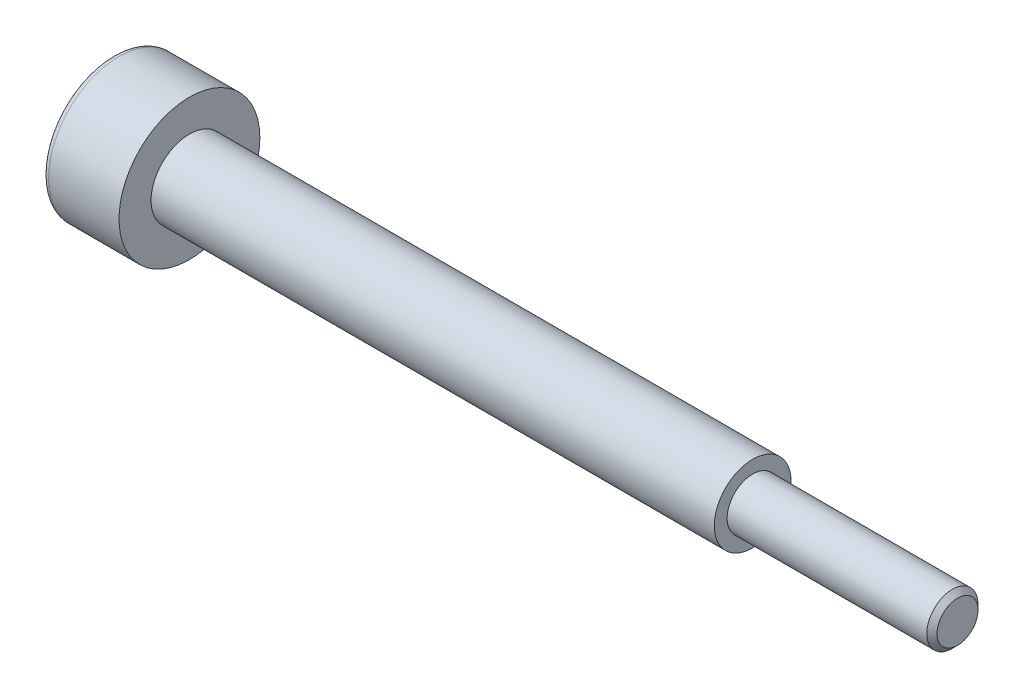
ISO-10303-21;
HEADER;
FILE_DESCRIPTION(('STEP AP214'),'2;1');
FILE_NAME('part.step','',(''),(''),'','','');
FILE_SCHEMA(('AUTOMOTIVE_DESIGN { 1 0 10303 214 1 1 1 1 }'));
ENDSEC;
DATA;
#1=APPLICATION_CONTEXT('core data for automotive mechanical design processes');
#2=APPLICATION_PROTOCOL_DEFINITION('international standard','automotive_design',2000,#1);
#3=PRODUCT_CONTEXT('',#1,'mechanical');
#4=PRODUCT('Part','Part','',(#3));
#5=PRODUCT_RELATED_PRODUCT_CATEGORY('part','',(#4));
#6=PRODUCT_DEFINITION_FORMATION('','',#4);
#7=PRODUCT_DEFINITION_CONTEXT('part definition',#1,'design');
#8=PRODUCT_DEFINITION('design','',#6,#7);
#9=PRODUCT_DEFINITION_SHAPE('','',#8);
#10=(LENGTH_UNIT() NAMED_UNIT(*) SI_UNIT(.MILLI.,.METRE.));
#11=(NAMED_UNIT(*) PLANE_ANGLE_UNIT() SI_UNIT($,.RADIAN.));
#12=(NAMED_UNIT(*) SI_UNIT($,.STERADIAN.) SOLID_ANGLE_UNIT());
#13=UNCERTAINTY_MEASURE_WITH_UNIT(LENGTH_MEASURE(1.E-05),#10,'distance_accuracy_value','');
#14=(GEOMETRIC_REPRESENTATION_CONTEXT(3) GLOBAL_UNCERTAINTY_ASSIGNED_CONTEXT((#13)) GLOBAL_UNIT_ASSIGNED_CONTEXT((#10,
#11,#12)) REPRESENTATION_CONTEXT('',''));
#15=CARTESIAN_POINT('',(0.,0.,0.));
#16=DIRECTION('',(0.,0.,1.));
#17=DIRECTION('',(1.,0.,0.));
#18=AXIS2_PLACEMENT_3D('',#15,#16,#17);
#19=CARTESIAN_POINT('',(12.5013072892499,0.,0.));
#20=DIRECTION('',(1.,0.,0.));
#21=DIRECTION('',(0.,0.,-1.));
#22=AXIS2_PLACEMENT_3D('',#19,#20,#21);
#23=CYLINDRICAL_SURFACE('',#22,1.5);
#24=CARTESIAN_POINT('',(0.,0.,0.));
#25=DIRECTION('',(1.,0.,0.));
#26=DIRECTION('',(0.,0.,-1.));
#27=AXIS2_PLACEMENT_3D('',#24,#25,#26);
#28=CIRCLE('',#27,1.5);
#29=CARTESIAN_POINT('',(0.,0.,-1.5));
#30=VERTEX_POINT('',#29);
#31=EDGE_CURVE('E139',#30,#30,#28,.T.);
#32=ORIENTED_EDGE('',*,*,#31,.T.);
#33=EDGE_LOOP('',(#32));
#34=FACE_BOUND('',#33,.T.);
#35=CARTESIAN_POINT('',(22.,0.,0.));
#36=DIRECTION('',(-1.,0.,0.));
#37=DIRECTION('',(0.,0.,1.));
#38=AXIS2_PLACEMENT_3D('',#35,#36,#37);
#39=CIRCLE('',#38,1.5);
#40=CARTESIAN_POINT('',(22.,0.,1.5));
#41=VERTEX_POINT('',#40);
#42=EDGE_CURVE('E340',#41,#41,#39,.T.);
#43=ORIENTED_EDGE('',*,*,#42,.T.);
#44=EDGE_LOOP('',(#43));
#45=FACE_BOUND('',#44,.T.);
#46=ADVANCED_FACE('F36',(#34,#45),#23,.T.);
#47=CARTESIAN_POINT('',(-3.,2.75,0.));
#48=DIRECTION('',(-1.,0.,0.));
#49=DIRECTION('',(0.,0.,1.));
#50=AXIS2_PLACEMENT_3D('',#47,#48,#49);
#51=PLANE('',#50);
#52=DIRECTION('',(0.,0.866025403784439,0.5));
#53=VECTOR('',#52,1.);
#54=CARTESIAN_POINT('',(-3.,-1.25,0.721687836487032));
#55=LINE('',#54,#53);
#56=CARTESIAN_POINT('',(-3.,-1.25,0.721687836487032));
#57=VERTEX_POINT('',#56);
#58=CARTESIAN_POINT('',(-3.,0.,1.44337567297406));
#59=VERTEX_POINT('',#58);
#60=EDGE_CURVE('E51',#57,#59,#55,.T.);
#61=ORIENTED_EDGE('',*,*,#60,.F.);
#62=DIRECTION('',(0.,0.,1.));
#63=VECTOR('',#62,1.);
#64=CARTESIAN_POINT('',(-3.,-1.25,-0.721687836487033));
#65=LINE('',#64,#63);
#66=CARTESIAN_POINT('',(-3.,-1.25,-0.721687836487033));
#67=VERTEX_POINT('',#66);
#68=EDGE_CURVE('E135',#67,#57,#65,.T.);
#69=ORIENTED_EDGE('',*,*,#68,.F.);
#70=DIRECTION('',(0.,-0.866025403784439,0.5));
#71=VECTOR('',#70,1.);
#72=CARTESIAN_POINT('',(-3.,0.,-1.44337567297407));
#73=LINE('',#72,#71);
#74=CARTESIAN_POINT('',(-3.,0.,-1.44337567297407));
#75=VERTEX_POINT('',#74);
#76=EDGE_CURVE('E133',#75,#67,#73,.T.);
#77=ORIENTED_EDGE('',*,*,#76,.F.);
#78=DIRECTION('',(0.,-0.866025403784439,-0.5));
#79=VECTOR('',#78,1.);
#80=CARTESIAN_POINT('',(-3.,1.25,-0.721687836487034));
#81=LINE('',#80,#79);
#82=CARTESIAN_POINT('',(-3.,1.25,-0.721687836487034));
#83=VERTEX_POINT('',#82);
#84=EDGE_CURVE('E99',#83,#75,#81,.T.);
#85=ORIENTED_EDGE('',*,*,#84,.F.);
#86=DIRECTION('',(0.,0.,-1.));
#87=VECTOR('',#86,1.);
#88=CARTESIAN_POINT('',(-3.,1.25,0.72168783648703));
#89=LINE('',#88,#87);
#90=CARTESIAN_POINT('',(-3.,1.25,0.72168783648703));
#91=VERTEX_POINT('',#90);
#92=EDGE_CURVE('E129',#91,#83,#89,.T.);
#93=ORIENTED_EDGE('',*,*,#92,.F.);
#94=DIRECTION('',(0.,0.866025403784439,-0.5));
#95=VECTOR('',#94,1.);
#96=CARTESIAN_POINT('',(-3.,0.,1.44337567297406));
#97=LINE('',#96,#95);
#98=EDGE_CURVE('E125',#59,#91,#97,.T.);
#99=ORIENTED_EDGE('',*,*,#98,.F.);
#100=EDGE_LOOP('',(#61,#69,#77,#85,#93,#99));
#101=FACE_BOUND('',#100,.T.);
#102=CARTESIAN_POINT('',(-3.,0.,0.));
#103=DIRECTION('',(-1.,0.,0.));
#104=DIRECTION('',(0.,0.,1.));
#105=AXIS2_PLACEMENT_3D('',#102,#103,#104);
#106=CIRCLE('',#105,2.5);
#107=CARTESIAN_POINT('',(-3.,0.,2.5));
#108=VERTEX_POINT('',#107);
#109=EDGE_CURVE('E153',#108,#108,#106,.T.);
#110=ORIENTED_EDGE('',*,*,#109,.T.);
#111=EDGE_LOOP('',(#110));
#112=FACE_BOUND('',#111,.T.);
#113=ADVANCED_FACE('F171',(#101,#112),#51,.T.);
#114=CARTESIAN_POINT('',(12.5013072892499,0.,0.));
#115=DIRECTION('',(1.,0.,0.));
#116=DIRECTION('',(0.,0.,-1.));
#117=AXIS2_PLACEMENT_3D('',#114,#115,#116);
#118=CYLINDRICAL_SURFACE('',#117,2.75);
#119=CARTESIAN_POINT('',(-2.75,0.,0.));
#120=DIRECTION('',(-1.,0.,0.));
#121=DIRECTION('',(0.,0.,1.));
#122=AXIS2_PLACEMENT_3D('',#119,#120,#121);
#123=CIRCLE('',#122,2.75);
#124=CARTESIAN_POINT('',(-2.75,0.,2.75));
#125=VERTEX_POINT('',#124);
#126=EDGE_CURVE('E150',#125,#125,#123,.F.);
#127=ORIENTED_EDGE('',*,*,#126,.T.);
#128=EDGE_LOOP('',(#127));
#129=FACE_BOUND('',#128,.T.);
#130=CARTESIAN_POINT('',(0.,0.,0.));
#131=DIRECTION('',(1.,0.,0.));
#132=DIRECTION('',(0.,0.,-1.));
#133=AXIS2_PLACEMENT_3D('',#130,#131,#132);
#134=CIRCLE('',#133,2.75);
#135=CARTESIAN_POINT('',(0.,0.,-2.75));
#136=VERTEX_POINT('',#135);
#137=EDGE_CURVE('E147',#136,#136,#134,.T.);
#138=ORIENTED_EDGE('',*,*,#137,.F.);
#139=EDGE_LOOP('',(#138));
#140=FACE_BOUND('',#139,.T.);
#141=ADVANCED_FACE('F177',(#129,#140),#118,.T.);
#142=CARTESIAN_POINT('',(0.,1.5,0.));
#143=DIRECTION('',(1.,0.,0.));
#144=DIRECTION('',(0.,0.,-1.));
#145=AXIS2_PLACEMENT_3D('',#142,#143,#144);
#146=PLANE('',#145);
#147=ORIENTED_EDGE('',*,*,#137,.T.);
#148=EDGE_LOOP('',(#147));
#149=FACE_BOUND('',#148,.T.);
#150=ORIENTED_EDGE('',*,*,#31,.F.);
#151=EDGE_LOOP('',(#150));
#152=FACE_BOUND('',#151,.T.);
#153=ADVANCED_FACE('F184',(#149,#152),#146,.T.);
#154=CARTESIAN_POINT('',(-2.75,0.,0.));
#155=DIRECTION('',(-1.,0.,0.));
#156=DIRECTION('',(0.,0.,1.));
#157=AXIS2_PLACEMENT_3D('',#154,#155,#156);
#158=TOROIDAL_SURFACE('',#157,2.5,0.25);
#159=ORIENTED_EDGE('',*,*,#109,.F.);
#160=EDGE_LOOP('',(#159));
#161=FACE_BOUND('',#160,.T.);
#162=ORIENTED_EDGE('',*,*,#126,.F.);
#163=EDGE_LOOP('',(#162));
#164=FACE_BOUND('',#163,.T.);
#165=ADVANCED_FACE('F181',(#161,#164),#158,.T.);
#166=CARTESIAN_POINT('',(-1.3,-1.25,0.721687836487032));
#167=DIRECTION('',(0.,-0.5,0.866025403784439));
#168=DIRECTION('',(0.,-0.866025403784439,-0.5));
#169=AXIS2_PLACEMENT_3D('',#166,#167,#168);
#170=PLANE('',#169);
#171=ORIENTED_EDGE('',*,*,#60,.T.);
#172=DIRECTION('',(-1.,0.,0.));
#173=VECTOR('',#172,1.);
#174=CARTESIAN_POINT('',(-1.3,0.,1.44337567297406));
#175=LINE('',#174,#173);
#176=CARTESIAN_POINT('',(-1.3,0.,1.44337567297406));
#177=VERTEX_POINT('',#176);
#178=EDGE_CURVE('E81',#177,#59,#175,.T.);
#179=ORIENTED_EDGE('',*,*,#178,.F.);
#180=DIRECTION('',(0.,0.866025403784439,0.5));
#181=VECTOR('',#180,1.);
#182=CARTESIAN_POINT('',(-1.3,-1.25,0.721687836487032));
#183=LINE('',#182,#181);
#184=CARTESIAN_POINT('',(-1.3,-1.25,0.721687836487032));
#185=VERTEX_POINT('',#184);
#186=EDGE_CURVE('E137',#185,#177,#183,.T.);
#187=ORIENTED_EDGE('',*,*,#186,.F.);
#188=DIRECTION('',(-1.,0.,0.));
#189=VECTOR('',#188,1.);
#190=CARTESIAN_POINT('',(-1.3,-1.25,0.721687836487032));
#191=LINE('',#190,#189);
#192=EDGE_CURVE('E59',#185,#57,#191,.T.);
#193=ORIENTED_EDGE('',*,*,#192,.T.);
#194=EDGE_LOOP('',(#171,#179,#187,#193));
#195=FACE_BOUND('',#194,.T.);
#196=ADVANCED_FACE('F183',(#195),#170,.F.);
#197=CARTESIAN_POINT('',(-1.3,-1.25,-0.721687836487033));
#198=DIRECTION('',(0.,-1.,0.));
#199=DIRECTION('',(0.,0.,-1.));
#200=AXIS2_PLACEMENT_3D('',#197,#198,#199);
#201=PLANE('',#200);
#202=ORIENTED_EDGE('',*,*,#68,.T.);
#203=ORIENTED_EDGE('',*,*,#192,.F.);
#204=DIRECTION('',(0.,0.,1.));
#205=VECTOR('',#204,1.);
#206=CARTESIAN_POINT('',(-1.3,-1.25,-0.721687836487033));
#207=LINE('',#206,#205);
#208=CARTESIAN_POINT('',(-1.3,-1.25,-0.721687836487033));
#209=VERTEX_POINT('',#208);
#210=EDGE_CURVE('E111',#209,#185,#207,.T.);
#211=ORIENTED_EDGE('',*,*,#210,.F.);
#212=DIRECTION('',(-1.,0.,0.));
#213=VECTOR('',#212,1.);
#214=CARTESIAN_POINT('',(-1.3,-1.25,-0.721687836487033));
#215=LINE('',#214,#213);
#216=EDGE_CURVE('E103',#209,#67,#215,.T.);
#217=ORIENTED_EDGE('',*,*,#216,.T.);
#218=EDGE_LOOP('',(#202,#203,#211,#217));
#219=FACE_BOUND('',#218,.T.);
#220=ADVANCED_FACE('F190',(#219),#201,.F.);
#221=CARTESIAN_POINT('',(-1.3,0.,-1.44337567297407));
#222=DIRECTION('',(0.,-0.5,-0.866025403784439));
#223=DIRECTION('',(0.,0.866025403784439,-0.5));
#224=AXIS2_PLACEMENT_3D('',#221,#222,#223);
#225=PLANE('',#224);
#226=ORIENTED_EDGE('',*,*,#76,.T.);
#227=ORIENTED_EDGE('',*,*,#216,.F.);
#228=DIRECTION('',(0.,-0.866025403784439,0.5));
#229=VECTOR('',#228,1.);
#230=CARTESIAN_POINT('',(-1.3,0.,-1.44337567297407));
#231=LINE('',#230,#229);
#232=CARTESIAN_POINT('',(-1.3,0.,-1.44337567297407));
#233=VERTEX_POINT('',#232);
#234=EDGE_CURVE('E107',#233,#209,#231,.T.);
#235=ORIENTED_EDGE('',*,*,#234,.F.);
#236=DIRECTION('',(-1.,0.,0.));
#237=VECTOR('',#236,1.);
#238=CARTESIAN_POINT('',(-1.3,0.,-1.44337567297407));
#239=LINE('',#238,#237);
#240=EDGE_CURVE('E92',#233,#75,#239,.T.);
#241=ORIENTED_EDGE('',*,*,#240,.T.);
#242=EDGE_LOOP('',(#226,#227,#235,#241));
#243=FACE_BOUND('',#242,.T.);
#244=ADVANCED_FACE('F108',(#243),#225,.F.);
#245=CARTESIAN_POINT('',(-1.3,1.25,-0.721687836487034));
#246=DIRECTION('',(0.,0.5,-0.866025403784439));
#247=DIRECTION('',(0.,0.866025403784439,0.5));
#248=AXIS2_PLACEMENT_3D('',#245,#246,#247);
#249=PLANE('',#248);
#250=ORIENTED_EDGE('',*,*,#84,.T.);
#251=ORIENTED_EDGE('',*,*,#240,.F.);
#252=DIRECTION('',(0.,-0.866025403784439,-0.5));
#253=VECTOR('',#252,1.);
#254=CARTESIAN_POINT('',(-1.3,1.25,-0.721687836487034));
#255=LINE('',#254,#253);
#256=CARTESIAN_POINT('',(-1.3,1.25,-0.721687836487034));
#257=VERTEX_POINT('',#256);
#258=EDGE_CURVE('E96',#257,#233,#255,.T.);
#259=ORIENTED_EDGE('',*,*,#258,.F.);
#260=DIRECTION('',(-1.,0.,0.));
#261=VECTOR('',#260,1.);
#262=CARTESIAN_POINT('',(-1.3,1.25,-0.721687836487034));
#263=LINE('',#262,#261);
#264=EDGE_CURVE('E104',#257,#83,#263,.T.);
#265=ORIENTED_EDGE('',*,*,#264,.T.);
#266=EDGE_LOOP('',(#250,#251,#259,#265));
#267=FACE_BOUND('',#266,.T.);
#268=ADVANCED_FACE('F94',(#267),#249,.F.);
#269=CARTESIAN_POINT('',(-1.3,1.25,0.72168783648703));
#270=DIRECTION('',(0.,1.,0.));
#271=DIRECTION('',(0.,0.,1.));
#272=AXIS2_PLACEMENT_3D('',#269,#270,#271);
#273=PLANE('',#272);
#274=ORIENTED_EDGE('',*,*,#92,.T.);
#275=ORIENTED_EDGE('',*,*,#264,.F.);
#276=DIRECTION('',(0.,0.,-1.));
#277=VECTOR('',#276,1.);
#278=CARTESIAN_POINT('',(-1.3,1.25,0.72168783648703));
#279=LINE('',#278,#277);
#280=CARTESIAN_POINT('',(-1.3,1.25,0.72168783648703));
#281=VERTEX_POINT('',#280);
#282=EDGE_CURVE('E117',#281,#257,#279,.T.);
#283=ORIENTED_EDGE('',*,*,#282,.F.);
#284=DIRECTION('',(-1.,0.,0.));
#285=VECTOR('',#284,1.);
#286=CARTESIAN_POINT('',(-1.3,1.25,0.72168783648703));
#287=LINE('',#286,#285);
#288=EDGE_CURVE('E142',#281,#91,#287,.T.);
#289=ORIENTED_EDGE('',*,*,#288,.T.);
#290=EDGE_LOOP('',(#274,#275,#283,#289));
#291=FACE_BOUND('',#290,.T.);
#292=ADVANCED_FACE('F210',(#291),#273,.F.);
#293=CARTESIAN_POINT('',(-1.3,0.,1.44337567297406));
#294=DIRECTION('',(0.,0.5,0.866025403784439));
#295=DIRECTION('',(0.,-0.866025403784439,0.5));
#296=AXIS2_PLACEMENT_3D('',#293,#294,#295);
#297=PLANE('',#296);
#298=ORIENTED_EDGE('',*,*,#98,.T.);
#299=ORIENTED_EDGE('',*,*,#288,.F.);
#300=DIRECTION('',(0.,0.866025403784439,-0.5));
#301=VECTOR('',#300,1.);
#302=CARTESIAN_POINT('',(-1.3,0.,1.44337567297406));
#303=LINE('',#302,#301);
#304=EDGE_CURVE('E119',#177,#281,#303,.T.);
#305=ORIENTED_EDGE('',*,*,#304,.F.);
#306=ORIENTED_EDGE('',*,*,#178,.T.);
#307=EDGE_LOOP('',(#298,#299,#305,#306));
#308=FACE_BOUND('',#307,.T.);
#309=ADVANCED_FACE('F207',(#308),#297,.F.);
#310=CARTESIAN_POINT('',(-1.3,1.25,2.1650635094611));
#311=DIRECTION('',(-1.,0.,0.));
#312=DIRECTION('',(0.,0.,1.));
#313=AXIS2_PLACEMENT_3D('',#310,#311,#312);
#314=PLANE('',#313);
#315=ORIENTED_EDGE('',*,*,#186,.T.);
#316=ORIENTED_EDGE('',*,*,#304,.T.);
#317=ORIENTED_EDGE('',*,*,#282,.T.);
#318=ORIENTED_EDGE('',*,*,#258,.T.);
#319=ORIENTED_EDGE('',*,*,#234,.T.);
#320=ORIENTED_EDGE('',*,*,#210,.T.);
#321=EDGE_LOOP('',(#315,#316,#317,#318,#319,#320));
#322=FACE_BOUND('',#321,.T.);
#323=ADVANCED_FACE('F114',(#322),#314,.T.);
#324=CARTESIAN_POINT('',(22.,1.5,0.));
#325=DIRECTION('',(1.,0.,0.));
#326=DIRECTION('',(0.,0.,-1.));
#327=AXIS2_PLACEMENT_3D('',#324,#325,#326);
#328=PLANE('',#327);
#329=CARTESIAN_POINT('',(22.,0.,0.));
#330=DIRECTION('',(-1.,0.,0.));
#331=DIRECTION('',(0.,0.,1.));
#332=AXIS2_PLACEMENT_3D('',#329,#330,#331);
#333=CIRCLE('',#332,1.);
#334=CARTESIAN_POINT('',(22.,0.,1.));
#335=VERTEX_POINT('',#334);
#336=EDGE_CURVE('E126',#335,#335,#333,.T.);
#337=ORIENTED_EDGE('',*,*,#336,.T.);
#338=EDGE_LOOP('',(#337));
#339=FACE_BOUND('',#338,.T.);
#340=ORIENTED_EDGE('',*,*,#42,.F.);
#341=EDGE_LOOP('',(#340));
#342=FACE_BOUND('',#341,.T.);
#343=ADVANCED_FACE('F223',(#339,#342),#328,.T.);
#344=CARTESIAN_POINT('',(0.,0.,0.));
#345=DIRECTION('',(-1.,0.,0.));
#346=DIRECTION('',(0.,0.,1.));
#347=AXIS2_PLACEMENT_3D('',#344,#345,#346);
#348=CYLINDRICAL_SURFACE('',#347,1.);
#349=CARTESIAN_POINT('',(29.8,0.,0.));
#350=DIRECTION('',(1.,0.,0.));
#351=DIRECTION('',(0.,0.,-1.));
#352=AXIS2_PLACEMENT_3D('',#349,#350,#351);
#353=CIRCLE('',#352,1.);
#354=CARTESIAN_POINT('',(29.8,0.,-1.));
#355=VERTEX_POINT('',#354);
#356=EDGE_CURVE('E44',#355,#355,#353,.F.);
#357=ORIENTED_EDGE('',*,*,#356,.T.);
#358=EDGE_LOOP('',(#357));
#359=FACE_BOUND('',#358,.T.);
#360=ORIENTED_EDGE('',*,*,#336,.F.);
#361=EDGE_LOOP('',(#360));
#362=FACE_BOUND('',#361,.T.);
#363=ADVANCED_FACE('F158',(#359,#362),#348,.T.);
#364=CARTESIAN_POINT('',(30.,1.5,0.));
#365=DIRECTION('',(1.,0.,0.));
#366=DIRECTION('',(0.,0.,-1.));
#367=AXIS2_PLACEMENT_3D('',#364,#365,#366);
#368=PLANE('',#367);
#369=CARTESIAN_POINT('',(30.,0.,0.));
#370=DIRECTION('',(1.,0.,0.));
#371=DIRECTION('',(0.,0.,-1.));
#372=AXIS2_PLACEMENT_3D('',#369,#370,#371);
#373=CIRCLE('',#372,0.799999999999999);
#374=CARTESIAN_POINT('',(30.,0.,-0.799999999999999));
#375=VERTEX_POINT('',#374);
#376=EDGE_CURVE('E11',#375,#375,#373,.T.);
#377=ORIENTED_EDGE('',*,*,#376,.T.);
#378=EDGE_LOOP('',(#377));
#379=FACE_BOUND('',#378,.T.);
#380=ADVANCED_FACE('F162',(#379),#368,.T.);
#381=CARTESIAN_POINT('',(29.8,0.,0.));
#382=DIRECTION('',(-1.,0.,0.));
#383=DIRECTION('',(0.,0.,1.));
#384=AXIS2_PLACEMENT_3D('',#381,#382,#383);
#385=CONICAL_SURFACE('',#384,1.,0.785398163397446);
#386=ORIENTED_EDGE('',*,*,#376,.F.);
#387=EDGE_LOOP('',(#386));
#388=FACE_BOUND('',#387,.T.);
#389=ORIENTED_EDGE('',*,*,#356,.F.);
#390=EDGE_LOOP('',(#389));
#391=FACE_BOUND('',#390,.T.);
#392=ADVANCED_FACE('F38',(#388,#391),#385,.T.);
#393=CLOSED_SHELL('',(#46,#113,#141,#153,#165,#196,#220,#244,#268,#292,#309,#323,#343,#363,#380,#392));
#394=MANIFOLD_SOLID_BREP('B2',#393);
#395=ADVANCED_BREP_SHAPE_REPRESENTATION('',(#18,#394),#14);
#396=SHAPE_DEFINITION_REPRESENTATION(#9,#395);
ENDSEC;
END-ISO-10303-21;
